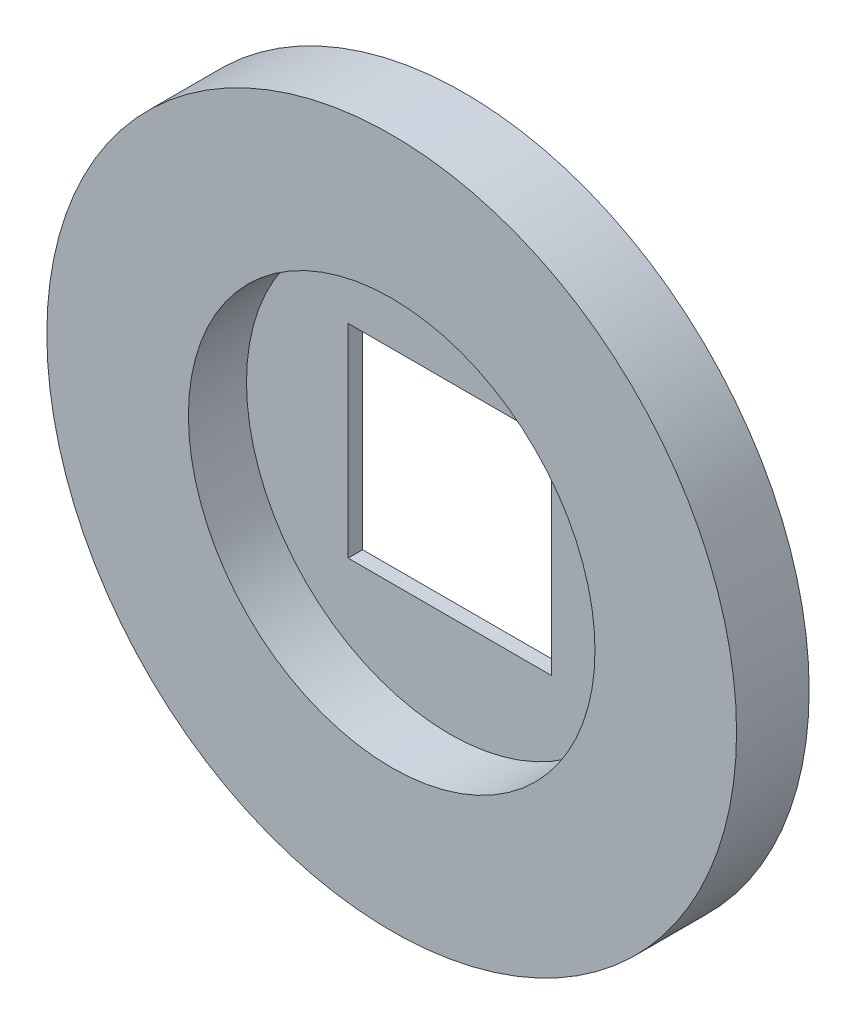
ISO-10303-21;
HEADER;
FILE_DESCRIPTION(('STEP AP214'),'2;1');
FILE_NAME('part.step','',(''),(''),'','','');
FILE_SCHEMA(('AUTOMOTIVE_DESIGN { 1 0 10303 214 1 1 1 1 }'));
ENDSEC;
DATA;
#1=APPLICATION_CONTEXT('core data for automotive mechanical design processes');
#2=APPLICATION_PROTOCOL_DEFINITION('international standard','automotive_design',2000,#1);
#3=PRODUCT_CONTEXT('',#1,'mechanical');
#4=PRODUCT('Part','Part','',(#3));
#5=PRODUCT_RELATED_PRODUCT_CATEGORY('part','',(#4));
#6=PRODUCT_DEFINITION_FORMATION('','',#4);
#7=PRODUCT_DEFINITION_CONTEXT('part definition',#1,'design');
#8=PRODUCT_DEFINITION('design','',#6,#7);
#9=PRODUCT_DEFINITION_SHAPE('','',#8);
#10=(LENGTH_UNIT() NAMED_UNIT(*) SI_UNIT(.MILLI.,.METRE.));
#11=(NAMED_UNIT(*) PLANE_ANGLE_UNIT() SI_UNIT($,.RADIAN.));
#12=(NAMED_UNIT(*) SI_UNIT($,.STERADIAN.) SOLID_ANGLE_UNIT());
#13=UNCERTAINTY_MEASURE_WITH_UNIT(LENGTH_MEASURE(1.E-05),#10,'distance_accuracy_value','');
#14=(GEOMETRIC_REPRESENTATION_CONTEXT(3) GLOBAL_UNCERTAINTY_ASSIGNED_CONTEXT((#13)) GLOBAL_UNIT_ASSIGNED_CONTEXT((#10,
#11,#12)) REPRESENTATION_CONTEXT('',''));
#15=CARTESIAN_POINT('',(0.,0.,0.));
#16=DIRECTION('',(0.,0.,1.));
#17=DIRECTION('',(1.,0.,0.));
#18=AXIS2_PLACEMENT_3D('',#15,#16,#17);
#19=CARTESIAN_POINT('',(0.,0.,10.));
#20=DIRECTION('',(0.,0.,-1.));
#21=DIRECTION('',(-1.,0.,0.));
#22=AXIS2_PLACEMENT_3D('',#19,#20,#21);
#23=CYLINDRICAL_SURFACE('',#22,47.5);
#24=CARTESIAN_POINT('',(0.,0.,10.));
#25=DIRECTION('',(0.,0.,1.));
#26=DIRECTION('',(1.,0.,0.));
#27=AXIS2_PLACEMENT_3D('',#24,#25,#26);
#28=CIRCLE('',#27,47.5);
#29=CARTESIAN_POINT('',(47.5,0.,10.));
#30=VERTEX_POINT('',#29);
#31=EDGE_CURVE('E11',#30,#30,#28,.T.);
#32=ORIENTED_EDGE('',*,*,#31,.F.);
#33=EDGE_LOOP('',(#32));
#34=FACE_BOUND('',#33,.T.);
#35=CARTESIAN_POINT('',(0.,0.,0.));
#36=DIRECTION('',(0.,0.,1.));
#37=DIRECTION('',(1.,0.,0.));
#38=AXIS2_PLACEMENT_3D('',#35,#36,#37);
#39=CIRCLE('',#38,47.5);
#40=CARTESIAN_POINT('',(47.5,0.,0.));
#41=VERTEX_POINT('',#40);
#42=EDGE_CURVE('E31',#41,#41,#39,.T.);
#43=ORIENTED_EDGE('',*,*,#42,.T.);
#44=EDGE_LOOP('',(#43));
#45=FACE_BOUND('',#44,.T.);
#46=ADVANCED_FACE('F24',(#34,#45),#23,.T.);
#47=CARTESIAN_POINT('',(0.,0.,10.));
#48=DIRECTION('',(0.,0.,1.));
#49=DIRECTION('',(1.,0.,0.));
#50=AXIS2_PLACEMENT_3D('',#47,#48,#49);
#51=PLANE('',#50);
#52=CARTESIAN_POINT('',(0.,0.,10.));
#53=DIRECTION('',(0.,0.,1.));
#54=DIRECTION('',(1.,0.,0.));
#55=AXIS2_PLACEMENT_3D('',#52,#53,#54);
#56=CIRCLE('',#55,28.);
#57=CARTESIAN_POINT('',(28.,0.,10.));
#58=VERTEX_POINT('',#57);
#59=EDGE_CURVE('E98',#58,#58,#56,.T.);
#60=ORIENTED_EDGE('',*,*,#59,.F.);
#61=EDGE_LOOP('',(#60));
#62=FACE_BOUND('',#61,.T.);
#63=ORIENTED_EDGE('',*,*,#31,.T.);
#64=EDGE_LOOP('',(#63));
#65=FACE_BOUND('',#64,.T.);
#66=ADVANCED_FACE('F112',(#62,#65),#51,.T.);
#67=CARTESIAN_POINT('',(0.,0.,0.));
#68=DIRECTION('',(0.,0.,1.));
#69=DIRECTION('',(1.,0.,0.));
#70=AXIS2_PLACEMENT_3D('',#67,#68,#69);
#71=PLANE('',#70);
#72=DIRECTION('',(-1.,0.,0.));
#73=VECTOR('',#72,1.);
#74=CARTESIAN_POINT('',(-14.,14.,0.));
#75=LINE('',#74,#73);
#76=CARTESIAN_POINT('',(14.,14.,0.));
#77=VERTEX_POINT('',#76);
#78=CARTESIAN_POINT('',(-14.,14.,0.));
#79=VERTEX_POINT('',#78);
#80=EDGE_CURVE('E93',#77,#79,#75,.T.);
#81=ORIENTED_EDGE('',*,*,#80,.T.);
#82=DIRECTION('',(0.,-1.,0.));
#83=VECTOR('',#82,1.);
#84=CARTESIAN_POINT('',(-14.,14.,0.));
#85=LINE('',#84,#83);
#86=CARTESIAN_POINT('',(-14.,-14.,0.));
#87=VERTEX_POINT('',#86);
#88=EDGE_CURVE('E84',#79,#87,#85,.T.);
#89=ORIENTED_EDGE('',*,*,#88,.T.);
#90=DIRECTION('',(1.,0.,0.));
#91=VECTOR('',#90,1.);
#92=CARTESIAN_POINT('',(-14.,-14.,0.));
#93=LINE('',#92,#91);
#94=CARTESIAN_POINT('',(14.,-14.,0.));
#95=VERTEX_POINT('',#94);
#96=EDGE_CURVE('E90',#87,#95,#93,.T.);
#97=ORIENTED_EDGE('',*,*,#96,.T.);
#98=DIRECTION('',(0.,1.,0.));
#99=VECTOR('',#98,1.);
#100=CARTESIAN_POINT('',(14.,14.,0.));
#101=LINE('',#100,#99);
#102=EDGE_CURVE('E38',#95,#77,#101,.T.);
#103=ORIENTED_EDGE('',*,*,#102,.T.);
#104=EDGE_LOOP('',(#81,#89,#97,#103));
#105=FACE_BOUND('',#104,.T.);
#106=ORIENTED_EDGE('',*,*,#42,.F.);
#107=EDGE_LOOP('',(#106));
#108=FACE_BOUND('',#107,.T.);
#109=ADVANCED_FACE('F109',(#105,#108),#71,.F.);
#110=CARTESIAN_POINT('',(0.,0.,2.));
#111=DIRECTION('',(0.,0.,1.));
#112=DIRECTION('',(1.,0.,0.));
#113=AXIS2_PLACEMENT_3D('',#110,#111,#112);
#114=CYLINDRICAL_SURFACE('',#113,28.);
#115=CARTESIAN_POINT('',(0.,0.,2.));
#116=DIRECTION('',(0.,0.,1.));
#117=DIRECTION('',(1.,0.,0.));
#118=AXIS2_PLACEMENT_3D('',#115,#116,#117);
#119=CIRCLE('',#118,28.);
#120=CARTESIAN_POINT('',(28.,0.,2.));
#121=VERTEX_POINT('',#120);
#122=EDGE_CURVE('E103',#121,#121,#119,.T.);
#123=ORIENTED_EDGE('',*,*,#122,.F.);
#124=EDGE_LOOP('',(#123));
#125=FACE_BOUND('',#124,.T.);
#126=ORIENTED_EDGE('',*,*,#59,.T.);
#127=EDGE_LOOP('',(#126));
#128=FACE_BOUND('',#127,.T.);
#129=ADVANCED_FACE('F111',(#125,#128),#114,.F.);
#130=CARTESIAN_POINT('',(0.,0.,2.));
#131=DIRECTION('',(0.,0.,1.));
#132=DIRECTION('',(1.,0.,0.));
#133=AXIS2_PLACEMENT_3D('',#130,#131,#132);
#134=PLANE('',#133);
#135=DIRECTION('',(0.,-1.,0.));
#136=VECTOR('',#135,1.);
#137=CARTESIAN_POINT('',(-14.,14.,2.));
#138=LINE('',#137,#136);
#139=CARTESIAN_POINT('',(-14.,14.,2.));
#140=VERTEX_POINT('',#139);
#141=CARTESIAN_POINT('',(-14.,-14.,2.));
#142=VERTEX_POINT('',#141);
#143=EDGE_CURVE('E46',#140,#142,#138,.T.);
#144=ORIENTED_EDGE('',*,*,#143,.F.);
#145=DIRECTION('',(-1.,0.,0.));
#146=VECTOR('',#145,1.);
#147=CARTESIAN_POINT('',(-14.,14.,2.));
#148=LINE('',#147,#146);
#149=CARTESIAN_POINT('',(14.,14.,2.));
#150=VERTEX_POINT('',#149);
#151=EDGE_CURVE('E82',#150,#140,#148,.T.);
#152=ORIENTED_EDGE('',*,*,#151,.F.);
#153=DIRECTION('',(0.,1.,0.));
#154=VECTOR('',#153,1.);
#155=CARTESIAN_POINT('',(14.,14.,2.));
#156=LINE('',#155,#154);
#157=CARTESIAN_POINT('',(14.,-14.,2.));
#158=VERTEX_POINT('',#157);
#159=EDGE_CURVE('E66',#158,#150,#156,.T.);
#160=ORIENTED_EDGE('',*,*,#159,.F.);
#161=DIRECTION('',(1.,0.,0.));
#162=VECTOR('',#161,1.);
#163=CARTESIAN_POINT('',(-14.,-14.,2.));
#164=LINE('',#163,#162);
#165=EDGE_CURVE('E75',#142,#158,#164,.T.);
#166=ORIENTED_EDGE('',*,*,#165,.F.);
#167=EDGE_LOOP('',(#144,#152,#160,#166));
#168=FACE_BOUND('',#167,.T.);
#169=ORIENTED_EDGE('',*,*,#122,.T.);
#170=EDGE_LOOP('',(#169));
#171=FACE_BOUND('',#170,.T.);
#172=ADVANCED_FACE('F79',(#168,#171),#134,.T.);
#173=CARTESIAN_POINT('',(-14.,14.,0.));
#174=DIRECTION('',(-1.,0.,0.));
#175=DIRECTION('',(0.,-1.,0.));
#176=AXIS2_PLACEMENT_3D('',#173,#174,#175);
#177=PLANE('',#176);
#178=ORIENTED_EDGE('',*,*,#143,.T.);
#179=DIRECTION('',(0.,0.,1.));
#180=VECTOR('',#179,1.);
#181=CARTESIAN_POINT('',(-14.,-14.,0.));
#182=LINE('',#181,#180);
#183=EDGE_CURVE('E72',#87,#142,#182,.T.);
#184=ORIENTED_EDGE('',*,*,#183,.F.);
#185=ORIENTED_EDGE('',*,*,#88,.F.);
#186=DIRECTION('',(0.,0.,1.));
#187=VECTOR('',#186,1.);
#188=CARTESIAN_POINT('',(-14.,14.,0.));
#189=LINE('',#188,#187);
#190=EDGE_CURVE('E96',#79,#140,#189,.T.);
#191=ORIENTED_EDGE('',*,*,#190,.T.);
#192=EDGE_LOOP('',(#178,#184,#185,#191));
#193=FACE_BOUND('',#192,.T.);
#194=ADVANCED_FACE('F145',(#193),#177,.F.);
#195=CARTESIAN_POINT('',(-14.,14.,0.));
#196=DIRECTION('',(0.,1.,0.));
#197=DIRECTION('',(0.,0.,1.));
#198=AXIS2_PLACEMENT_3D('',#195,#196,#197);
#199=PLANE('',#198);
#200=ORIENTED_EDGE('',*,*,#151,.T.);
#201=ORIENTED_EDGE('',*,*,#190,.F.);
#202=ORIENTED_EDGE('',*,*,#80,.F.);
#203=DIRECTION('',(0.,0.,1.));
#204=VECTOR('',#203,1.);
#205=CARTESIAN_POINT('',(14.,14.,0.));
#206=LINE('',#205,#204);
#207=EDGE_CURVE('E71',#77,#150,#206,.T.);
#208=ORIENTED_EDGE('',*,*,#207,.T.);
#209=EDGE_LOOP('',(#200,#201,#202,#208));
#210=FACE_BOUND('',#209,.T.);
#211=ADVANCED_FACE('F152',(#210),#199,.F.);
#212=CARTESIAN_POINT('',(14.,14.,0.));
#213=DIRECTION('',(1.,0.,0.));
#214=DIRECTION('',(0.,1.,0.));
#215=AXIS2_PLACEMENT_3D('',#212,#213,#214);
#216=PLANE('',#215);
#217=ORIENTED_EDGE('',*,*,#159,.T.);
#218=ORIENTED_EDGE('',*,*,#207,.F.);
#219=ORIENTED_EDGE('',*,*,#102,.F.);
#220=DIRECTION('',(0.,0.,1.));
#221=VECTOR('',#220,1.);
#222=CARTESIAN_POINT('',(14.,-14.,0.));
#223=LINE('',#222,#221);
#224=EDGE_CURVE('E62',#95,#158,#223,.T.);
#225=ORIENTED_EDGE('',*,*,#224,.T.);
#226=EDGE_LOOP('',(#217,#218,#219,#225));
#227=FACE_BOUND('',#226,.T.);
#228=ADVANCED_FACE('F64',(#227),#216,.F.);
#229=CARTESIAN_POINT('',(-14.,-14.,0.));
#230=DIRECTION('',(0.,-1.,0.));
#231=DIRECTION('',(0.,0.,-1.));
#232=AXIS2_PLACEMENT_3D('',#229,#230,#231);
#233=PLANE('',#232);
#234=ORIENTED_EDGE('',*,*,#165,.T.);
#235=ORIENTED_EDGE('',*,*,#224,.F.);
#236=ORIENTED_EDGE('',*,*,#96,.F.);
#237=ORIENTED_EDGE('',*,*,#183,.T.);
#238=EDGE_LOOP('',(#234,#235,#236,#237));
#239=FACE_BOUND('',#238,.T.);
#240=ADVANCED_FACE('F76',(#239),#233,.F.);
#241=CLOSED_SHELL('',(#46,#66,#109,#129,#172,#194,#211,#228,#240));
#242=MANIFOLD_SOLID_BREP('B2',#241);
#243=ADVANCED_BREP_SHAPE_REPRESENTATION('',(#18,#242),#14);
#244=SHAPE_DEFINITION_REPRESENTATION(#9,#243);
ENDSEC;
END-ISO-10303-21;
